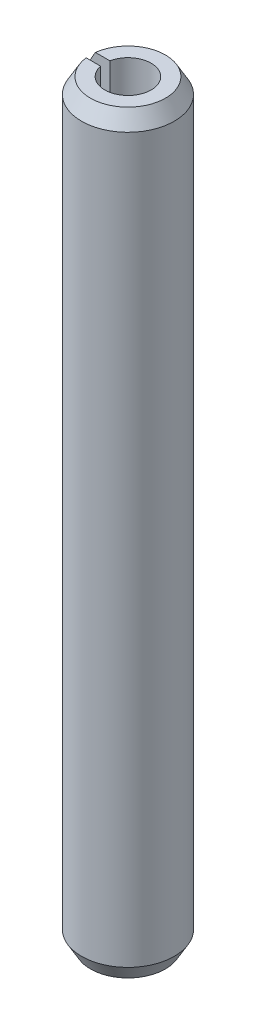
from build123d import *

# Parameters (mm, degrees)
ESQUISSE1_W                  = 2
ESQUISSE1_H                  = 65
CHANFREIN1_SIZE              = 1.333333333
CHANFREIN1_SIZE2             = 0.769800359
ENL_V_MAT_EXTRU_1_DEPTH      = 33.988634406
ENL_V_MAT_EXTRU_1_DEPTH_BACK = 33.988634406
ESQUISSE2_W                  = 4
ESQUISSE2_H                  = 0.8


with BuildPart() as part:
    # Esquisse1 → Base-R_volution (revolve)
    with BuildSketch(Plane.XY, mode=Mode.PRIVATE) as base_r_volution_sk:
        with Locations((3, 0)):
            Rectangle(ESQUISSE1_W, ESQUISSE1_H)
    revolve(base_r_volution_sk.sketch.rotate(Axis((0, 32.5, 0), (0, -1, 0)), 90), axis=Axis((0, 32.5, 0), (0, -1, 0)))

    # Chanfrein1
    chanfrein1_edges = [part.edges().sort_by_distance(p)[0] for p in [
        (0, -32.5, -4),
        (0, 32.5, -4),
    ]]
    chanfrein1_side = [part.faces().sort_by_distance(p)[0] for p in [
        (0, 0, -4),
    ]]
    chamfer(chanfrein1_edges, length=CHANFREIN1_SIZE, length2=CHANFREIN1_SIZE2, reference=chanfrein1_side[0])

    # Esquisse2 → Enl_v. mat.-Extru.1 (cut, two sides: drawn at the far end of the back side and taken through both)
    with BuildSketch(Plane(origin=(0, 0, 0), x_dir=(-1, 0, 0), z_dir=(0, 1, 0)).offset(-ENL_V_MAT_EXTRU_1_DEPTH_BACK)):
        with Locations((2, 0)):
            Rectangle(ESQUISSE2_W, ESQUISSE2_H)
    extrude(amount=ENL_V_MAT_EXTRU_1_DEPTH + ENL_V_MAT_EXTRU_1_DEPTH_BACK, mode=Mode.SUBTRACT)


solid = part.part
